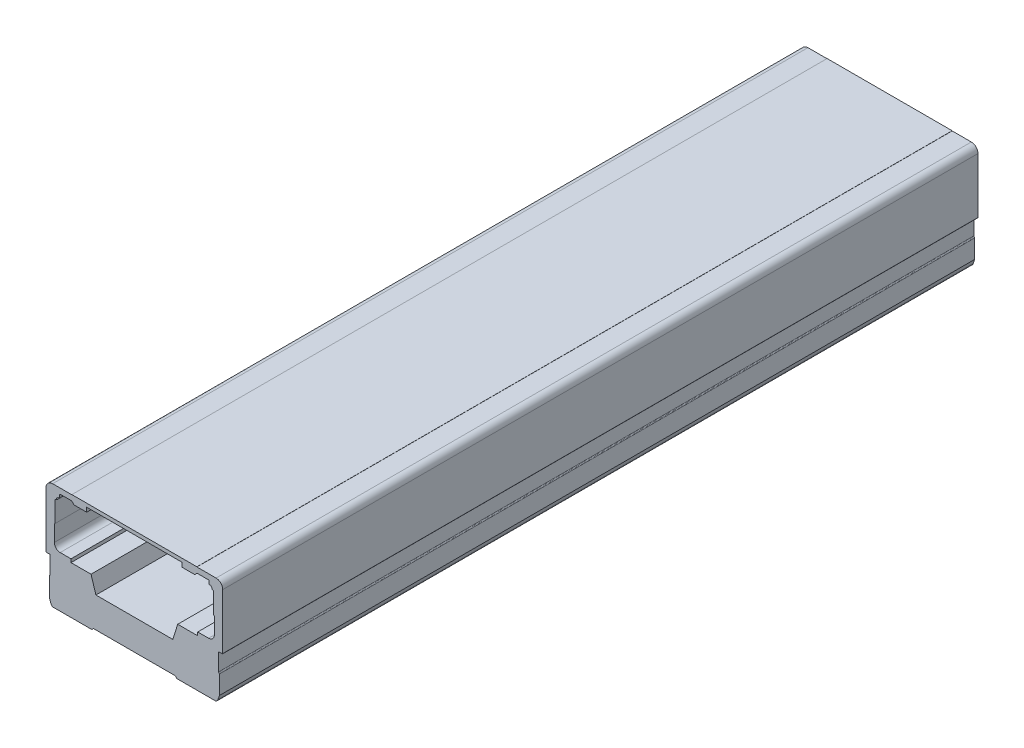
from build123d import *

# Parameters (mm, degrees)
EXTRUDE_1_DEPTH        = 453
HOLE_WIZARD_M5_1_D     = 4.2
HOLE_WIZARD_M5_1_DEPTH = 11.4
HOLE_WIZARD_M5_1_TIP   = 1.2618073


with BuildPart() as part:
    # Sketch 1 → Extrude 1 (new body)
    with BuildSketch(Plane.XY):
        with BuildLine():
            Line((37.5, 44.837148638), (37.5, 44.937148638))
            Line((37.5, 44.937148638), (-37.5, 44.937148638))
            Line((-37.5, 44.937148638), (-37.5, 44.837148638))
            Line((-37.5, 44.837148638), (-49, 44.837148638))
            ThreePointArc((-49, 44.837148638), (-51.828427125, 43.665575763), (-53, 40.837148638))
            Line((-53, 40.837148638), (-53, 7.637148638))
            ThreePointArc((-53, 7.637148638), (-52.912132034, 7.425016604), (-52.7, 7.337148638))
            Line((-52.7, 7.337148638), (-50.5, 7.337148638))
            Line((-50.5, 7.337148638), (-50.5, -3.162851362))
            ThreePointArc((-50.5, -3.162851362), (-50.566987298, -3.412851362), (-50.75, -3.595864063))
            ThreePointArc((-50.75, -3.595864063), (-50.933012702, -3.778876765), (-51, -4.028876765))
            Line((-51, -4.028876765), (-51, -15.162851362))
            Line((-51, -15.162851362), (-50.137801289, -17.666858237))
            ThreePointArc((-50.137801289, -17.666858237), (-49.689081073, -18.50625993), (-49, -19.162851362))
            Line((-49, -19.162851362), (-25.5, -19.162851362))
            Line((-25.5, -19.162851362), (-24.5, -18.162851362))
            Line((-24.5, -18.162851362), (24.5, -18.162851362))
            Line((24.5, -18.162851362), (25.5, -19.162851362))
            Line((25.5, -19.162851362), (49, -19.162851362))
            ThreePointArc((49, -19.162851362), (49.687879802, -18.507838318), (50.136507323, -17.670608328))
            Line((50.136507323, -17.670608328), (50.999999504, -15.162850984))
            Line((50.999999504, -15.162850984), (50.999999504, -4.028876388))
            ThreePointArc((50.999999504, -4.028876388), (50.933012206, -3.778876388), (50.749999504, -3.595863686))
            ThreePointArc((50.749999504, -3.595863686), (50.566986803, -3.412850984), (50.499999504, -3.162850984))
            Line((50.499999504, -3.162850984), (50.499999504, 7.337148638))
            Line((50.499999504, 7.337148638), (52.7, 7.337148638))
            ThreePointArc((52.7, 7.337148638), (52.912132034, 7.425016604), (53, 7.637148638))
            Line((53, 7.637148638), (53, 40.837148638))
            ThreePointArc((53, 40.837148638), (51.828427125, 43.665575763), (49, 44.837148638))
            Line((49, 44.837148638), (37.5, 44.837148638))
        make_face()
        with BuildLine():
            Line((-47.6, 24.837148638), (-48, 24.537148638))
            Line((-48, 24.537148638), (-48, 14.837148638))
            ThreePointArc((-48, 14.837148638), (-46.974873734, 12.362274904), (-44.5, 11.337148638))
            Line((-44.5, 11.337148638), (-38, 11.337148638))
            Line((-38, 11.337148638), (-38, 9.337148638))
            Line((-38, 9.337148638), (-26, 9.337148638))
            Line((-26, 9.337148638), (-23.056008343, 0))
            Line((-23.056008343, 0), (23.056008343, 0))
            Line((23.056008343, 0), (26, 9.337148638))
            Line((26, 9.337148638), (38, 9.337148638))
            Line((38, 9.337148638), (38, 11.337148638))
            Line((38, 11.337148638), (44.5, 11.337148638))
            ThreePointArc((44.5, 11.337148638), (46.974873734, 12.362274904), (48, 14.837148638))
            Line((48, 14.837148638), (48, 24.537148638))
            Line((48, 24.537148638), (47.6, 24.837148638))
            Line((47.6, 24.837148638), (47.6, 37.075247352))
            ThreePointArc((47.6, 37.075247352), (47.479393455, 37.400916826), (47.175757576, 37.56947482))
            ThreePointArc((47.175757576, 37.56947482), (46.809680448, 37.650999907), (46.45778258, 37.780717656))
            Line((46.45778258, 37.780717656), (46.73829413, 38.532304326))
            ThreePointArc((46.73829413, 38.532304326), (46.185786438, 38.922935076), (45.795155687, 39.475442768))
            Line((45.795155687, 39.475442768), (45.043569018, 39.194931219))
            ThreePointArc((45.043569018, 39.194931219), (44.861569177, 39.753199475), (44.8, 40.337148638))
            Line((44.8, 40.337148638), (44.8, 41.137148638))
            ThreePointArc((44.8, 41.137148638), (44.653553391, 41.490702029), (44.3, 41.637148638))
            Line((44.3, 41.637148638), (37.6, 41.637148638))
            Line((37.6, 41.637148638), (36.2, 40.237148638))
            Line((36.2, 40.237148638), (28.6, 40.237148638))
            Line((28.6, 40.237148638), (28.6, 42.837148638))
            Line((28.6, 42.837148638), (-28.6, 42.837148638))
            Line((-28.6, 42.837148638), (-28.6, 40.237148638))
            Line((-28.6, 40.237148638), (-36.2, 40.237148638))
            Line((-36.2, 40.237148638), (-37.6, 41.637148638))
            Line((-37.6, 41.637148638), (-44.3, 41.637148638))
            ThreePointArc((-44.3, 41.637148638), (-44.653553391, 41.490702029), (-44.8, 41.137148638))
            Line((-44.8, 41.137148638), (-44.8, 40.337148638))
            ThreePointArc((-44.8, 40.337148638), (-44.861569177, 39.753199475), (-45.043569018, 39.194931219))
            Line((-45.043569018, 39.194931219), (-45.795155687, 39.475442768))
            ThreePointArc((-45.795155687, 39.475442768), (-46.185786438, 38.922935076), (-46.73829413, 38.532304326))
            Line((-46.73829413, 38.532304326), (-46.45778258, 37.780717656))
            ThreePointArc((-46.45778258, 37.780717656), (-46.809680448, 37.650999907), (-47.175757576, 37.56947482))
            ThreePointArc((-47.175757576, 37.56947482), (-47.479393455, 37.400916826), (-47.6, 37.075247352))
            Line((-47.6, 37.075247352), (-47.6, 24.837148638))
        make_face(mode=Mode.SUBTRACT)
    extrude(amount=EXTRUDE_1_DEPTH)

    # Hole Wizard M5 _1
    with Locations(Plane(origin=(0, -19.162851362, 0), x_dir=(-1, 0, 0), z_dir=(0, -1, 0))):
        with Locations((42.5, -422.5), (-42.5, -422.5), (42.5, -222.5), (42.5, -22.5), (42.5, 177.5), (42.5, 377.5), (42.5, 577.5), (42.5, 777.5), (-42.5, 577.5), (-42.5, 377.5), (-42.5, 177.5), (-42.5, -22.5), (-42.5, -222.5)):
            Hole(HOLE_WIZARD_M5_1_D / 2, depth=HOLE_WIZARD_M5_1_DEPTH)
            with Locations((0, 0, -(HOLE_WIZARD_M5_1_DEPTH + HOLE_WIZARD_M5_1_TIP / 2))):  # 118° drill point
                Cone(0, HOLE_WIZARD_M5_1_D / 2, HOLE_WIZARD_M5_1_TIP, mode=Mode.SUBTRACT)


solid = part.part
